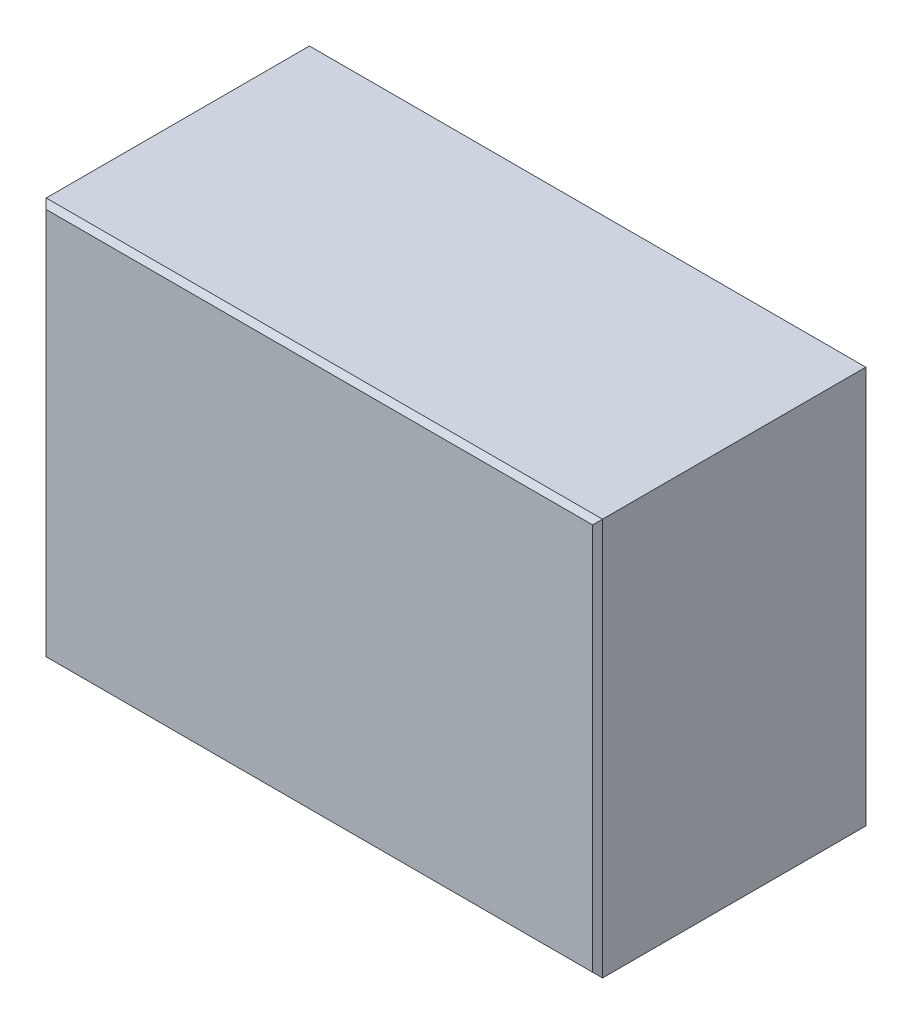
ISO-10303-21;
HEADER;
FILE_DESCRIPTION(('STEP AP214'),'2;1');
FILE_NAME('part.step','',(''),(''),'','','');
FILE_SCHEMA(('AUTOMOTIVE_DESIGN { 1 0 10303 214 1 1 1 1 }'));
ENDSEC;
DATA;
#1=APPLICATION_CONTEXT('core data for automotive mechanical design processes');
#2=APPLICATION_PROTOCOL_DEFINITION('international standard','automotive_design',2000,#1);
#3=PRODUCT_CONTEXT('',#1,'mechanical');
#4=PRODUCT('Part','Part','',(#3));
#5=PRODUCT_RELATED_PRODUCT_CATEGORY('part','',(#4));
#6=PRODUCT_DEFINITION_FORMATION('','',#4);
#7=PRODUCT_DEFINITION_CONTEXT('part definition',#1,'design');
#8=PRODUCT_DEFINITION('design','',#6,#7);
#9=PRODUCT_DEFINITION_SHAPE('','',#8);
#10=(LENGTH_UNIT() NAMED_UNIT(*) SI_UNIT(.MILLI.,.METRE.));
#11=(NAMED_UNIT(*) PLANE_ANGLE_UNIT() SI_UNIT($,.RADIAN.));
#12=(NAMED_UNIT(*) SI_UNIT($,.STERADIAN.) SOLID_ANGLE_UNIT());
#13=UNCERTAINTY_MEASURE_WITH_UNIT(LENGTH_MEASURE(1.E-05),#10,'distance_accuracy_value','');
#14=(GEOMETRIC_REPRESENTATION_CONTEXT(3) GLOBAL_UNCERTAINTY_ASSIGNED_CONTEXT((#13)) GLOBAL_UNIT_ASSIGNED_CONTEXT((#10,
#11,#12)) REPRESENTATION_CONTEXT('',''));
#15=CARTESIAN_POINT('',(0.,0.,0.));
#16=DIRECTION('',(0.,0.,1.));
#17=DIRECTION('',(1.,0.,0.));
#18=AXIS2_PLACEMENT_3D('',#15,#16,#17);
#19=CARTESIAN_POINT('',(-5.6,4.,5.5));
#20=DIRECTION('',(1.,0.,0.));
#21=DIRECTION('',(0.,1.,0.));
#22=AXIS2_PLACEMENT_3D('',#19,#20,#21);
#23=PLANE('',#22);
#24=DIRECTION('',(0.,0.,-1.));
#25=VECTOR('',#24,1.);
#26=CARTESIAN_POINT('',(-5.6,4.,5.5));
#27=LINE('',#26,#25);
#28=CARTESIAN_POINT('',(-5.6,4.,5.4));
#29=VERTEX_POINT('',#28);
#30=CARTESIAN_POINT('',(-5.6,4.,0.100000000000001));
#31=VERTEX_POINT('',#30);
#32=EDGE_CURVE('E141',#29,#31,#27,.T.);
#33=ORIENTED_EDGE('',*,*,#32,.T.);
#34=DIRECTION('',(0.,-1.,0.));
#35=VECTOR('',#34,1.);
#36=CARTESIAN_POINT('',(-5.6,4.,0.100000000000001));
#37=LINE('',#36,#35);
#38=CARTESIAN_POINT('',(-5.6,-4.,0.100000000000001));
#39=VERTEX_POINT('',#38);
#40=EDGE_CURVE('E150',#31,#39,#37,.T.);
#41=ORIENTED_EDGE('',*,*,#40,.T.);
#42=DIRECTION('',(0.,0.,-1.));
#43=VECTOR('',#42,1.);
#44=CARTESIAN_POINT('',(-5.6,-4.,5.5));
#45=LINE('',#44,#43);
#46=CARTESIAN_POINT('',(-5.6,-4.,5.4));
#47=VERTEX_POINT('',#46);
#48=EDGE_CURVE('E119',#47,#39,#45,.T.);
#49=ORIENTED_EDGE('',*,*,#48,.F.);
#50=DIRECTION('',(0.,1.,0.));
#51=VECTOR('',#50,1.);
#52=CARTESIAN_POINT('',(-5.6,4.,5.4));
#53=LINE('',#52,#51);
#54=EDGE_CURVE('E152',#47,#29,#53,.T.);
#55=ORIENTED_EDGE('',*,*,#54,.T.);
#56=EDGE_LOOP('',(#33,#41,#49,#55));
#57=FACE_BOUND('',#56,.T.);
#58=ADVANCED_FACE('F32',(#57),#23,.F.);
#59=CARTESIAN_POINT('',(-5.6,-4.,5.5));
#60=DIRECTION('',(0.,1.,0.));
#61=DIRECTION('',(0.,0.,1.));
#62=AXIS2_PLACEMENT_3D('',#59,#60,#61);
#63=PLANE('',#62);
#64=ORIENTED_EDGE('',*,*,#48,.T.);
#65=DIRECTION('',(1.,0.,0.));
#66=VECTOR('',#65,1.);
#67=CARTESIAN_POINT('',(-5.6,-4.,0.100000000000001));
#68=LINE('',#67,#66);
#69=CARTESIAN_POINT('',(5.6,-4.,0.100000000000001));
#70=VERTEX_POINT('',#69);
#71=EDGE_CURVE('E118',#39,#70,#68,.T.);
#72=ORIENTED_EDGE('',*,*,#71,.T.);
#73=DIRECTION('',(0.,0.,-1.));
#74=VECTOR('',#73,1.);
#75=CARTESIAN_POINT('',(5.6,-4.,5.5));
#76=LINE('',#75,#74);
#77=CARTESIAN_POINT('',(5.6,-4.,5.4));
#78=VERTEX_POINT('',#77);
#79=EDGE_CURVE('E101',#78,#70,#76,.T.);
#80=ORIENTED_EDGE('',*,*,#79,.F.);
#81=DIRECTION('',(-1.,0.,0.));
#82=VECTOR('',#81,1.);
#83=CARTESIAN_POINT('',(-5.6,-4.,5.4));
#84=LINE('',#83,#82);
#85=EDGE_CURVE('E115',#78,#47,#84,.T.);
#86=ORIENTED_EDGE('',*,*,#85,.T.);
#87=EDGE_LOOP('',(#64,#72,#80,#86));
#88=FACE_BOUND('',#87,.T.);
#89=ADVANCED_FACE('F114',(#88),#63,.F.);
#90=CARTESIAN_POINT('',(5.6,4.,5.5));
#91=DIRECTION('',(-1.,0.,0.));
#92=DIRECTION('',(0.,-1.,0.));
#93=AXIS2_PLACEMENT_3D('',#90,#91,#92);
#94=PLANE('',#93);
#95=ORIENTED_EDGE('',*,*,#79,.T.);
#96=DIRECTION('',(0.,1.,0.));
#97=VECTOR('',#96,1.);
#98=CARTESIAN_POINT('',(5.6,4.,0.100000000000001));
#99=LINE('',#98,#97);
#100=CARTESIAN_POINT('',(5.6,4.,0.100000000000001));
#101=VERTEX_POINT('',#100);
#102=EDGE_CURVE('E107',#70,#101,#99,.T.);
#103=ORIENTED_EDGE('',*,*,#102,.T.);
#104=DIRECTION('',(0.,0.,-1.));
#105=VECTOR('',#104,1.);
#106=CARTESIAN_POINT('',(5.6,4.,5.5));
#107=LINE('',#106,#105);
#108=CARTESIAN_POINT('',(5.6,4.,5.4));
#109=VERTEX_POINT('',#108);
#110=EDGE_CURVE('E103',#109,#101,#107,.T.);
#111=ORIENTED_EDGE('',*,*,#110,.F.);
#112=DIRECTION('',(0.,-1.,0.));
#113=VECTOR('',#112,1.);
#114=CARTESIAN_POINT('',(5.6,-4.,5.4));
#115=LINE('',#114,#113);
#116=EDGE_CURVE('E98',#109,#78,#115,.T.);
#117=ORIENTED_EDGE('',*,*,#116,.T.);
#118=EDGE_LOOP('',(#95,#103,#111,#117));
#119=FACE_BOUND('',#118,.T.);
#120=ADVANCED_FACE('F100',(#119),#94,.F.);
#121=CARTESIAN_POINT('',(-5.6,4.,5.5));
#122=DIRECTION('',(0.,-1.,0.));
#123=DIRECTION('',(0.,0.,-1.));
#124=AXIS2_PLACEMENT_3D('',#121,#122,#123);
#125=PLANE('',#124);
#126=ORIENTED_EDGE('',*,*,#110,.T.);
#127=DIRECTION('',(-1.,0.,0.));
#128=VECTOR('',#127,1.);
#129=CARTESIAN_POINT('',(-5.6,4.,0.100000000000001));
#130=LINE('',#129,#128);
#131=EDGE_CURVE('E154',#101,#31,#130,.T.);
#132=ORIENTED_EDGE('',*,*,#131,.T.);
#133=ORIENTED_EDGE('',*,*,#32,.F.);
#134=DIRECTION('',(1.,0.,0.));
#135=VECTOR('',#134,1.);
#136=CARTESIAN_POINT('',(5.6,4.,5.4));
#137=LINE('',#136,#135);
#138=EDGE_CURVE('E156',#29,#109,#137,.T.);
#139=ORIENTED_EDGE('',*,*,#138,.T.);
#140=EDGE_LOOP('',(#126,#132,#133,#139));
#141=FACE_BOUND('',#140,.T.);
#142=ADVANCED_FACE('F194',(#141),#125,.F.);
#143=CARTESIAN_POINT('',(0.,0.,5.5));
#144=DIRECTION('',(0.,0.,1.));
#145=DIRECTION('',(1.,0.,0.));
#146=AXIS2_PLACEMENT_3D('',#143,#144,#145);
#147=PLANE('',#146);
#148=DIRECTION('',(0.,1.,0.));
#149=VECTOR('',#148,1.);
#150=CARTESIAN_POINT('',(5.5,4.,5.5));
#151=LINE('',#150,#149);
#152=CARTESIAN_POINT('',(5.50000000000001,-3.9,5.5));
#153=VERTEX_POINT('',#152);
#154=CARTESIAN_POINT('',(5.5,3.9,5.5));
#155=VERTEX_POINT('',#154);
#156=EDGE_CURVE('E41',#153,#155,#151,.T.);
#157=ORIENTED_EDGE('',*,*,#156,.T.);
#158=DIRECTION('',(-1.,0.,0.));
#159=VECTOR('',#158,1.);
#160=CARTESIAN_POINT('',(-5.6,3.9,5.5));
#161=LINE('',#160,#159);
#162=CARTESIAN_POINT('',(-5.5,3.9,5.5));
#163=VERTEX_POINT('',#162);
#164=EDGE_CURVE('E11',#155,#163,#161,.T.);
#165=ORIENTED_EDGE('',*,*,#164,.T.);
#166=DIRECTION('',(0.,-1.,0.));
#167=VECTOR('',#166,1.);
#168=CARTESIAN_POINT('',(-5.5,-4.,5.5));
#169=LINE('',#168,#167);
#170=CARTESIAN_POINT('',(-5.5,-3.9,5.5));
#171=VERTEX_POINT('',#170);
#172=EDGE_CURVE('E148',#163,#171,#169,.T.);
#173=ORIENTED_EDGE('',*,*,#172,.T.);
#174=DIRECTION('',(1.,0.,0.));
#175=VECTOR('',#174,1.);
#176=CARTESIAN_POINT('',(5.6,-3.9,5.5));
#177=LINE('',#176,#175);
#178=EDGE_CURVE('E52',#171,#153,#177,.T.);
#179=ORIENTED_EDGE('',*,*,#178,.T.);
#180=EDGE_LOOP('',(#157,#165,#173,#179));
#181=FACE_BOUND('',#180,.T.);
#182=ADVANCED_FACE('F200',(#181),#147,.T.);
#183=CARTESIAN_POINT('',(0.,0.,0.));
#184=DIRECTION('',(0.,0.,1.));
#185=DIRECTION('',(1.,0.,0.));
#186=AXIS2_PLACEMENT_3D('',#183,#184,#185);
#187=PLANE('',#186);
#188=DIRECTION('',(0.,-1.,0.));
#189=VECTOR('',#188,1.);
#190=CARTESIAN_POINT('',(5.5,0.,0.));
#191=LINE('',#190,#189);
#192=CARTESIAN_POINT('',(5.5,3.9,0.));
#193=VERTEX_POINT('',#192);
#194=CARTESIAN_POINT('',(5.5,-3.9,0.));
#195=VERTEX_POINT('',#194);
#196=EDGE_CURVE('E161',#193,#195,#191,.T.);
#197=ORIENTED_EDGE('',*,*,#196,.T.);
#198=DIRECTION('',(-1.,0.,0.));
#199=VECTOR('',#198,1.);
#200=CARTESIAN_POINT('',(0.,-3.9,0.));
#201=LINE('',#200,#199);
#202=CARTESIAN_POINT('',(-5.5,-3.9,0.));
#203=VERTEX_POINT('',#202);
#204=EDGE_CURVE('E108',#195,#203,#201,.T.);
#205=ORIENTED_EDGE('',*,*,#204,.T.);
#206=DIRECTION('',(0.,1.,0.));
#207=VECTOR('',#206,1.);
#208=CARTESIAN_POINT('',(-5.5,0.,0.));
#209=LINE('',#208,#207);
#210=CARTESIAN_POINT('',(-5.5,3.9,0.));
#211=VERTEX_POINT('',#210);
#212=EDGE_CURVE('E165',#203,#211,#209,.T.);
#213=ORIENTED_EDGE('',*,*,#212,.T.);
#214=DIRECTION('',(1.,0.,0.));
#215=VECTOR('',#214,1.);
#216=CARTESIAN_POINT('',(0.,3.9,0.));
#217=LINE('',#216,#215);
#218=EDGE_CURVE('E163',#211,#193,#217,.T.);
#219=ORIENTED_EDGE('',*,*,#218,.T.);
#220=EDGE_LOOP('',(#197,#205,#213,#219));
#221=FACE_BOUND('',#220,.T.);
#222=ADVANCED_FACE('F202',(#221),#187,.F.);
#223=CARTESIAN_POINT('',(-5.6,4.,0.100000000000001));
#224=DIRECTION('',(0.,-0.707106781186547,0.707106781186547));
#225=DIRECTION('',(-1.,0.,0.));
#226=AXIS2_PLACEMENT_3D('',#223,#224,#225);
#227=PLANE('',#226);
#228=DIRECTION('',(-0.577350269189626,-0.577350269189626,-0.577350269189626));
#229=VECTOR('',#228,1.);
#230=CARTESIAN_POINT('',(1.86666666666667,0.266666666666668,-3.63333333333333));
#231=LINE('',#230,#229);
#232=EDGE_CURVE('E142',#193,#101,#231,.F.);
#233=ORIENTED_EDGE('',*,*,#232,.F.);
#234=ORIENTED_EDGE('',*,*,#218,.F.);
#235=DIRECTION('',(0.577350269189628,-0.577350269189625,-0.577350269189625));
#236=VECTOR('',#235,1.);
#237=CARTESIAN_POINT('',(-5.6,4.,0.100000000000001));
#238=LINE('',#237,#236);
#239=EDGE_CURVE('E138',#31,#211,#238,.T.);
#240=ORIENTED_EDGE('',*,*,#239,.F.);
#241=ORIENTED_EDGE('',*,*,#131,.F.);
#242=EDGE_LOOP('',(#233,#234,#240,#241));
#243=FACE_BOUND('',#242,.T.);
#244=ADVANCED_FACE('F181',(#243),#227,.F.);
#245=CARTESIAN_POINT('',(-5.6,4.,0.100000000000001));
#246=DIRECTION('',(0.707106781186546,0.,0.707106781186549));
#247=DIRECTION('',(0.,-1.,0.));
#248=AXIS2_PLACEMENT_3D('',#245,#246,#247);
#249=PLANE('',#248);
#250=ORIENTED_EDGE('',*,*,#239,.T.);
#251=ORIENTED_EDGE('',*,*,#212,.F.);
#252=DIRECTION('',(-0.577350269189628,-0.577350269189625,0.577350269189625));
#253=VECTOR('',#252,1.);
#254=CARTESIAN_POINT('',(-2.93333333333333,-1.33333333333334,-2.56666666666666));
#255=LINE('',#254,#253);
#256=EDGE_CURVE('E129',#39,#203,#255,.F.);
#257=ORIENTED_EDGE('',*,*,#256,.F.);
#258=ORIENTED_EDGE('',*,*,#40,.F.);
#259=EDGE_LOOP('',(#250,#251,#257,#258));
#260=FACE_BOUND('',#259,.T.);
#261=ADVANCED_FACE('F185',(#260),#249,.F.);
#262=CARTESIAN_POINT('',(5.6,4.,0.100000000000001));
#263=DIRECTION('',(-0.707106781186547,0.,0.707106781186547));
#264=DIRECTION('',(0.,1.,0.));
#265=AXIS2_PLACEMENT_3D('',#262,#263,#264);
#266=PLANE('',#265);
#267=ORIENTED_EDGE('',*,*,#232,.T.);
#268=ORIENTED_EDGE('',*,*,#102,.F.);
#269=DIRECTION('',(-0.577350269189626,0.577350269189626,-0.577350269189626));
#270=VECTOR('',#269,1.);
#271=CARTESIAN_POINT('',(2.93333333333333,-1.33333333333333,-2.56666666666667));
#272=LINE('',#271,#270);
#273=EDGE_CURVE('E128',#195,#70,#272,.F.);
#274=ORIENTED_EDGE('',*,*,#273,.F.);
#275=ORIENTED_EDGE('',*,*,#196,.F.);
#276=EDGE_LOOP('',(#267,#268,#274,#275));
#277=FACE_BOUND('',#276,.T.);
#278=ADVANCED_FACE('F193',(#277),#266,.F.);
#279=CARTESIAN_POINT('',(-5.6,-4.,0.100000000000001));
#280=DIRECTION('',(0.,0.707106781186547,0.707106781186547));
#281=DIRECTION('',(1.,0.,0.));
#282=AXIS2_PLACEMENT_3D('',#279,#280,#281);
#283=PLANE('',#282);
#284=ORIENTED_EDGE('',*,*,#256,.T.);
#285=ORIENTED_EDGE('',*,*,#204,.F.);
#286=ORIENTED_EDGE('',*,*,#273,.T.);
#287=ORIENTED_EDGE('',*,*,#71,.F.);
#288=EDGE_LOOP('',(#284,#285,#286,#287));
#289=FACE_BOUND('',#288,.T.);
#290=ADVANCED_FACE('F188',(#289),#283,.F.);
#291=CARTESIAN_POINT('',(0.,-3.9,5.5));
#292=DIRECTION('',(0.,-0.707106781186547,0.707106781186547));
#293=DIRECTION('',(-1.,0.,0.));
#294=AXIS2_PLACEMENT_3D('',#291,#292,#293);
#295=PLANE('',#294);
#296=DIRECTION('',(0.577350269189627,0.577350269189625,0.577350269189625));
#297=VECTOR('',#296,1.);
#298=CARTESIAN_POINT('',(-4.2,-2.6,6.8));
#299=LINE('',#298,#297);
#300=EDGE_CURVE('E124',#47,#171,#299,.T.);
#301=ORIENTED_EDGE('',*,*,#300,.F.);
#302=ORIENTED_EDGE('',*,*,#85,.F.);
#303=DIRECTION('',(-0.577350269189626,0.577350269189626,0.577350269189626));
#304=VECTOR('',#303,1.);
#305=CARTESIAN_POINT('',(3.66666666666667,-2.06666666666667,7.33333333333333));
#306=LINE('',#305,#304);
#307=EDGE_CURVE('E36',#153,#78,#306,.F.);
#308=ORIENTED_EDGE('',*,*,#307,.F.);
#309=ORIENTED_EDGE('',*,*,#178,.F.);
#310=EDGE_LOOP('',(#301,#302,#308,#309));
#311=FACE_BOUND('',#310,.T.);
#312=ADVANCED_FACE('F34',(#311),#295,.T.);
#313=CARTESIAN_POINT('',(5.5,0.,5.5));
#314=DIRECTION('',(0.707106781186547,0.,0.707106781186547));
#315=DIRECTION('',(0.,-1.,0.));
#316=AXIS2_PLACEMENT_3D('',#313,#314,#315);
#317=PLANE('',#316);
#318=ORIENTED_EDGE('',*,*,#307,.T.);
#319=ORIENTED_EDGE('',*,*,#116,.F.);
#320=DIRECTION('',(-0.577350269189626,-0.577350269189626,0.577350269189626));
#321=VECTOR('',#320,1.);
#322=CARTESIAN_POINT('',(4.2,2.6,6.8));
#323=LINE('',#322,#321);
#324=EDGE_CURVE('E131',#155,#109,#323,.F.);
#325=ORIENTED_EDGE('',*,*,#324,.F.);
#326=ORIENTED_EDGE('',*,*,#156,.F.);
#327=EDGE_LOOP('',(#318,#319,#325,#326));
#328=FACE_BOUND('',#327,.T.);
#329=ADVANCED_FACE('F127',(#328),#317,.T.);
#330=CARTESIAN_POINT('',(-5.5,0.,5.5));
#331=DIRECTION('',(-0.707106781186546,0.,0.707106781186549));
#332=DIRECTION('',(0.,1.,0.));
#333=AXIS2_PLACEMENT_3D('',#330,#331,#332);
#334=PLANE('',#333);
#335=ORIENTED_EDGE('',*,*,#300,.T.);
#336=ORIENTED_EDGE('',*,*,#172,.F.);
#337=DIRECTION('',(-0.577350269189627,0.577350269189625,-0.577350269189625));
#338=VECTOR('',#337,1.);
#339=CARTESIAN_POINT('',(-4.2,2.6,6.8));
#340=LINE('',#339,#338);
#341=EDGE_CURVE('E134',#29,#163,#340,.F.);
#342=ORIENTED_EDGE('',*,*,#341,.F.);
#343=ORIENTED_EDGE('',*,*,#54,.F.);
#344=EDGE_LOOP('',(#335,#336,#342,#343));
#345=FACE_BOUND('',#344,.T.);
#346=ADVANCED_FACE('F199',(#345),#334,.T.);
#347=CARTESIAN_POINT('',(0.,3.9,5.5));
#348=DIRECTION('',(0.,0.707106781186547,0.707106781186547));
#349=DIRECTION('',(1.,0.,0.));
#350=AXIS2_PLACEMENT_3D('',#347,#348,#349);
#351=PLANE('',#350);
#352=ORIENTED_EDGE('',*,*,#324,.T.);
#353=ORIENTED_EDGE('',*,*,#138,.F.);
#354=ORIENTED_EDGE('',*,*,#341,.T.);
#355=ORIENTED_EDGE('',*,*,#164,.F.);
#356=EDGE_LOOP('',(#352,#353,#354,#355));
#357=FACE_BOUND('',#356,.T.);
#358=ADVANCED_FACE('F197',(#357),#351,.T.);
#359=CLOSED_SHELL('',(#58,#89,#120,#142,#182,#222,#244,#261,#278,#290,#312,#329,#346,#358));
#360=MANIFOLD_SOLID_BREP('B2',#359);
#361=ADVANCED_BREP_SHAPE_REPRESENTATION('',(#18,#360),#14);
#362=SHAPE_DEFINITION_REPRESENTATION(#9,#361);
ENDSEC;
END-ISO-10303-21;
